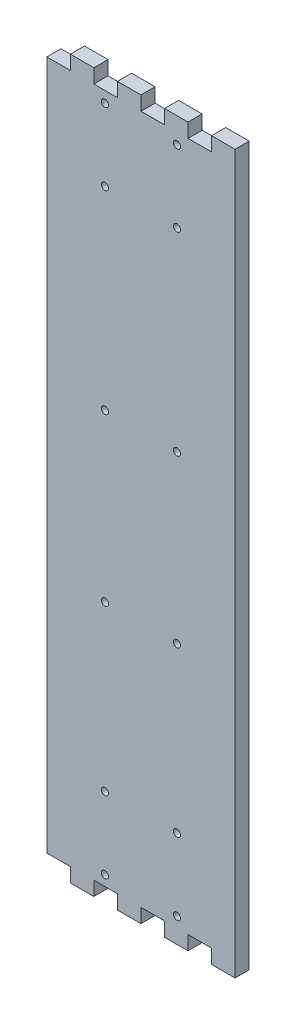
from build123d import *

# Parameters (mm, degrees)
ESTRUSIONE_ESTRUSIONE1_DEPTH = 6
SKETCH1_R                    = 1.5
CUT_EXTRUDE1_DEPTH           = 10


with BuildPart() as part:
    # Schizzo1 → Estrusione-Estrusione1 (new body)
    with BuildSketch(Plane.XY):
        Polygon((-40, 143), (-40, -150), (-30, -150), (-30, -156), (-20, -156), (-20, -150), (-10, -150), (-10, -156), (0, -156), (0, -150), (10, -150), (10, -156), (20, -156), (20, -150), (30, -150), (30, -156), (40, -156), (40, 149), (30, 149), (30, 143), (20, 143), (20, 149), (10, 149), (10, 143), (0, 143), (0, 149), (-10, 149), (-10, 143), (-20, 143), (-20, 149), (-30, 149), (-30, 143), align=None)
    extrude(amount=ESTRUSIONE_ESTRUSIONE1_DEPTH)

    # Sketch1 → Cut-Extrude1 (cut)
    with BuildSketch(Plane(origin=(46, 142.545283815, 6), x_dir=(0, 1, 0), z_dir=(0, 0, 1))):
        with Locations(Location((-288.178572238, 61.3, 0), (0, 0, 270))):
            Circle(SKETCH1_R)
        with Locations(Location((-257.578572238, 61.3, 0), (0, 0, 270))):
            Circle(SKETCH1_R)
        with Locations(Location((-288.178572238, 30.7, 0), (0, 0, 270))):
            Circle(SKETCH1_R)
        with Locations(Location((-257.578572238, 30.7, 0), (0, 0, 270))):
            Circle(SKETCH1_R)
        with Locations(Location((-4.245283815, 61.3, 0), (0, 0, 270))):
            Circle(SKETCH1_R)
        with Locations(Location((-34.845283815, 61.3, 0), (0, 0, 270))):
            Circle(SKETCH1_R)
        with Locations(Location((-34.845283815, 30.7, 0), (0, 0, 270))):
            Circle(SKETCH1_R)
        with Locations(Location((-4.245283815, 30.7, 0), (0, 0, 270))):
            Circle(SKETCH1_R)
        with Locations(Location((-187.845283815, 61.3, 0), (0, 0, 270))):
            Circle(SKETCH1_R)
        with Locations(Location((-187.845283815, 30.7, 0), (0, 0, 270))):
            Circle(SKETCH1_R)
        with Locations(Location((-117.245283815, 30.7, 0), (0, 0, 270))):
            Circle(SKETCH1_R)
        with Locations(Location((-117.245283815, 61.3, 0), (0, 0, 270))):
            Circle(SKETCH1_R)
    extrude(amount=-CUT_EXTRUDE1_DEPTH, mode=Mode.SUBTRACT)


solid = part.part
